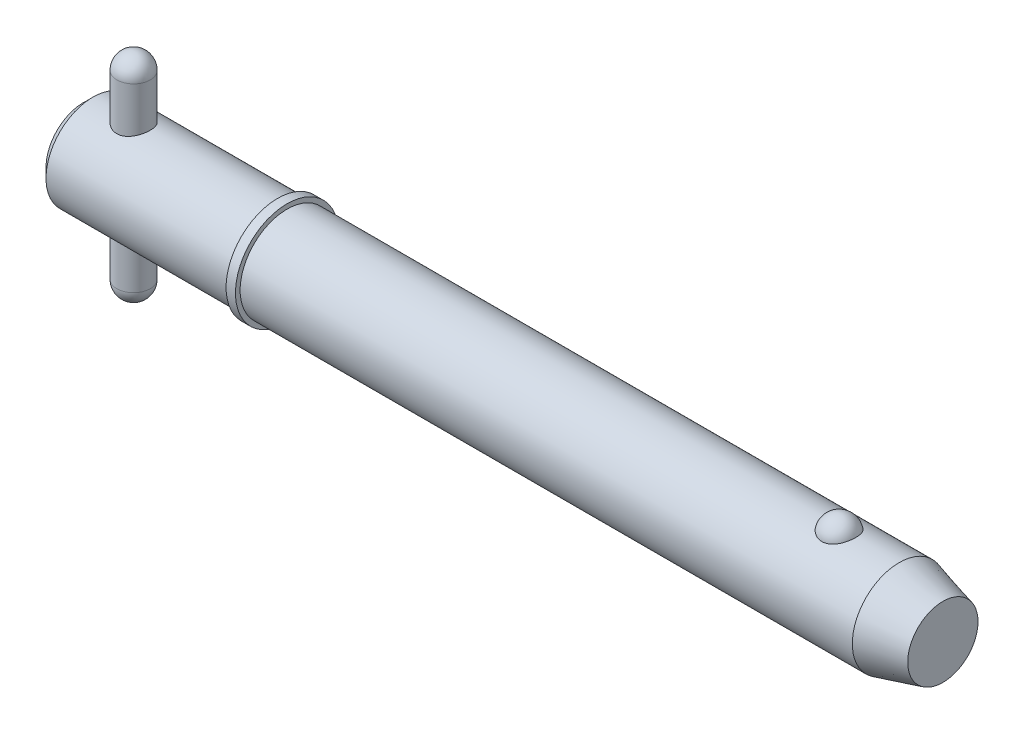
ISO-10303-21;
HEADER;
FILE_DESCRIPTION(('STEP AP214'),'2;1');
FILE_NAME('part.step','',(''),(''),'','','');
FILE_SCHEMA(('AUTOMOTIVE_DESIGN { 1 0 10303 214 1 1 1 1 }'));
ENDSEC;
DATA;
#1=APPLICATION_CONTEXT('core data for automotive mechanical design processes');
#2=APPLICATION_PROTOCOL_DEFINITION('international standard','automotive_design',2000,#1);
#3=PRODUCT_CONTEXT('',#1,'mechanical');
#4=PRODUCT('Part','Part','',(#3));
#5=PRODUCT_RELATED_PRODUCT_CATEGORY('part','',(#4));
#6=PRODUCT_DEFINITION_FORMATION('','',#4);
#7=PRODUCT_DEFINITION_CONTEXT('part definition',#1,'design');
#8=PRODUCT_DEFINITION('design','',#6,#7);
#9=PRODUCT_DEFINITION_SHAPE('','',#8);
#10=(LENGTH_UNIT() NAMED_UNIT(*) SI_UNIT(.MILLI.,.METRE.));
#11=(NAMED_UNIT(*) PLANE_ANGLE_UNIT() SI_UNIT($,.RADIAN.));
#12=(NAMED_UNIT(*) SI_UNIT($,.STERADIAN.) SOLID_ANGLE_UNIT());
#13=UNCERTAINTY_MEASURE_WITH_UNIT(LENGTH_MEASURE(1.E-05),#10,'distance_accuracy_value','');
#14=(GEOMETRIC_REPRESENTATION_CONTEXT(3) GLOBAL_UNCERTAINTY_ASSIGNED_CONTEXT((#13)) GLOBAL_UNIT_ASSIGNED_CONTEXT((#10,
#11,#12)) REPRESENTATION_CONTEXT('',''));
#15=CARTESIAN_POINT('',(0.,0.,0.));
#16=DIRECTION('',(0.,0.,1.));
#17=DIRECTION('',(1.,0.,0.));
#18=AXIS2_PLACEMENT_3D('',#15,#16,#17);
#19=CARTESIAN_POINT('',(5.94,12.7,0.));
#20=DIRECTION('',(0.,-1.,0.));
#21=DIRECTION('',(0.,0.,-1.));
#22=AXIS2_PLACEMENT_3D('',#19,#20,#21);
#23=CYLINDRICAL_SURFACE('',#22,1.98);
#24=CARTESIAN_POINT('',(5.94,-10.72,0.));
#25=DIRECTION('',(0.,-1.,0.));
#26=DIRECTION('',(0.,0.,-1.));
#27=AXIS2_PLACEMENT_3D('',#24,#25,#26);
#28=CIRCLE('',#27,1.98);
#29=CARTESIAN_POINT('',(5.94,-10.72,-1.98));
#30=VERTEX_POINT('',#29);
#31=EDGE_CURVE('P0_E10',#30,#30,#28,.F.);
#32=ORIENTED_EDGE('',*,*,#31,.T.);
#33=EDGE_LOOP('',(#32));
#34=FACE_BOUND('',#33,.T.);
#35=CARTESIAN_POINT('',(5.94,10.72,0.));
#36=DIRECTION('',(0.,-1.,0.));
#37=DIRECTION('',(0.,0.,-1.));
#38=AXIS2_PLACEMENT_3D('',#35,#36,#37);
#39=CIRCLE('',#38,1.98);
#40=CARTESIAN_POINT('',(5.94,10.72,-1.98));
#41=VERTEX_POINT('',#40);
#42=EDGE_CURVE('P0_E21',#41,#41,#39,.T.);
#43=ORIENTED_EDGE('',*,*,#42,.T.);
#44=EDGE_LOOP('',(#43));
#45=FACE_BOUND('',#44,.T.);
#46=ADVANCED_FACE('P0_F14',(#34,#45),#23,.T.);
#47=CARTESIAN_POINT('',(5.94,-10.72,0.));
#48=DIRECTION('',(0.,0.,1.));
#49=DIRECTION('',(1.,0.,0.));
#50=AXIS2_PLACEMENT_3D('',#47,#48,#49);
#51=SPHERICAL_SURFACE('',#50,1.98);
#52=CARTESIAN_POINT('',(5.94,-10.72,0.));
#53=DIRECTION('',(0.,-1.,0.));
#54=DIRECTION('',(0.,0.,-1.));
#55=AXIS2_PLACEMENT_3D('',#52,#53,#54);
#56=SPHERICAL_SURFACE('',#55,1.98);
#57=ORIENTED_EDGE('',*,*,#31,.F.);
#58=EDGE_LOOP('',(#57));
#59=FACE_BOUND('',#58,.T.);
#60=ADVANCED_FACE('P0_F29',(#59),#56,.T.);
#61=CARTESIAN_POINT('',(5.94,10.72,0.));
#62=DIRECTION('',(0.,0.,1.));
#63=DIRECTION('',(1.,0.,0.));
#64=AXIS2_PLACEMENT_3D('',#61,#62,#63);
#65=SPHERICAL_SURFACE('',#64,1.98);
#66=CARTESIAN_POINT('',(5.94,10.72,0.));
#67=DIRECTION('',(0.,-1.,0.));
#68=DIRECTION('',(0.,0.,-1.));
#69=AXIS2_PLACEMENT_3D('',#66,#67,#68);
#70=SPHERICAL_SURFACE('',#69,1.98);
#71=ORIENTED_EDGE('',*,*,#42,.F.);
#72=EDGE_LOOP('',(#71));
#73=FACE_BOUND('',#72,.T.);
#74=ADVANCED_FACE('P0_F16',(#73),#70,.T.);
#75=CLOSED_SHELL('',(#46,#60,#74));
#76=MANIFOLD_SOLID_BREP('P0_B1',#75);
#77=CARTESIAN_POINT('',(0.,0.,0.));
#78=DIRECTION('',(1.,0.,0.));
#79=DIRECTION('',(0.,0.,-1.));
#80=AXIS2_PLACEMENT_3D('',#77,#78,#79);
#81=CYLINDRICAL_SURFACE('',#80,5.555);
#82=CARTESIAN_POINT('',(96.7171144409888,0.,0.));
#83=DIRECTION('',(1.,0.,0.));
#84=DIRECTION('',(0.,0.,-1.));
#85=AXIS2_PLACEMENT_3D('',#82,#83,#84);
#86=CIRCLE('',#85,5.555);
#87=CARTESIAN_POINT('',(96.7171144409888,0.,-5.555));
#88=VERTEX_POINT('',#87);
#89=EDGE_CURVE('P1_E81',#88,#88,#86,.T.);
#90=ORIENTED_EDGE('',*,*,#89,.F.);
#91=EDGE_LOOP('',(#90));
#92=FACE_BOUND('',#91,.T.);
#93=CARTESIAN_POINT('',(24.13,0.,0.));
#94=DIRECTION('',(1.,0.,0.));
#95=DIRECTION('',(0.,0.,-1.));
#96=AXIS2_PLACEMENT_3D('',#93,#94,#95);
#97=CIRCLE('',#96,5.555);
#98=CARTESIAN_POINT('',(24.13,0.,-5.555));
#99=VERTEX_POINT('',#98);
#100=EDGE_CURVE('P1_E85',#99,#99,#97,.T.);
#101=ORIENTED_EDGE('',*,*,#100,.T.);
#102=EDGE_LOOP('',(#101));
#103=FACE_BOUND('',#102,.T.);
#104=CARTESIAN_POINT('',(89.5986264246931,5.16741224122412,2.03859650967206));
#105=CARTESIAN_POINT('',(89.4929492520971,5.16740893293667,2.03859990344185));
#106=CARTESIAN_POINT('',(89.3872989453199,5.17079470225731,2.03008306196));
#107=CARTESIAN_POINT('',(89.1791419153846,5.18392795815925,1.99630721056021));
#108=CARTESIAN_POINT('',(89.0766344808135,5.19367399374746,1.97105201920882));
#109=CARTESIAN_POINT('',(88.8777710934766,5.21839168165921,1.90463997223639));
#110=CARTESIAN_POINT('',(88.7814064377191,5.23335573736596,1.86350622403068));
#111=CARTESIAN_POINT('',(88.5970804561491,5.26688076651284,1.76652592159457));
#112=CARTESIAN_POINT('',(88.5091207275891,5.28544242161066,1.71067657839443));
#113=CARTESIAN_POINT('',(88.341265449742,5.32479845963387,1.58399959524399));
#114=CARTESIAN_POINT('',(88.2616656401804,5.34564089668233,1.51279545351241));
#115=CARTESIAN_POINT('',(88.1151290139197,5.38697258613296,1.3582858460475));
#116=CARTESIAN_POINT('',(88.048194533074,5.40746177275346,1.27497815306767));
#117=CARTESIAN_POINT('',(87.9256103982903,5.44694508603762,1.09440293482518));
#118=CARTESIAN_POINT('',(87.870598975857,5.46583143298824,0.996677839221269));
#119=CARTESIAN_POINT('',(87.7769376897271,5.49908030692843,0.792961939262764));
#120=CARTESIAN_POINT('',(87.7382894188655,5.513442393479,0.686970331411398));
#121=CARTESIAN_POINT('',(87.6776807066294,5.536358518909,0.468019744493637));
#122=CARTESIAN_POINT('',(87.6559725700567,5.54482455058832,0.354981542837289));
#123=CARTESIAN_POINT('',(87.6306362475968,5.55473324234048,0.126595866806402));
#124=CARTESIAN_POINT('',(87.6270077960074,5.55617600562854,0.0112484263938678));
#125=CARTESIAN_POINT('',(87.6378817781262,5.55189984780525,-0.218011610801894));
#126=CARTESIAN_POINT('',(87.6523151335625,5.54620821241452,-0.331928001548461));
#127=CARTESIAN_POINT('',(87.698903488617,5.52828920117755,-0.555544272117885));
#128=CARTESIAN_POINT('',(87.7310588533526,5.51606169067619,-0.665244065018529));
#129=CARTESIAN_POINT('',(87.8124883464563,5.48630779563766,-0.877469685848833));
#130=CARTESIAN_POINT('',(87.861781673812,5.4687754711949,-0.979987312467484));
#131=CARTESIAN_POINT('',(87.9764785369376,5.43024700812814,-1.17486975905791));
#132=CARTESIAN_POINT('',(88.0418831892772,5.40925062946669,-1.26723387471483));
#133=CARTESIAN_POINT('',(88.1875712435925,5.36600927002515,-1.43940133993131));
#134=CARTESIAN_POINT('',(88.2678859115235,5.34376173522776,-1.51917763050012));
#135=CARTESIAN_POINT('',(88.4414520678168,5.30057971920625,-1.66360338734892));
#136=CARTESIAN_POINT('',(88.534702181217,5.27964509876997,-1.72825445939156));
#137=CARTESIAN_POINT('',(88.7293939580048,5.24205250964,-1.83909478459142));
#138=CARTESIAN_POINT('',(88.8305900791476,5.22530519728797,-1.88568407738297));
#139=CARTESIAN_POINT('',(89.0401552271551,5.1975091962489,-1.96100802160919));
#140=CARTESIAN_POINT('',(89.1485215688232,5.1864583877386,-1.98974931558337));
#141=CARTESIAN_POINT('',(89.3634989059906,5.17184410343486,-2.02742262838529));
#142=CARTESIAN_POINT('',(89.469925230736,5.1679328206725,-2.03727608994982));
#143=CARTESIAN_POINT('',(89.6829925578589,5.16698995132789,-2.03966777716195));
#144=CARTESIAN_POINT('',(89.7896335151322,5.16995704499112,-2.03220932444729));
#145=CARTESIAN_POINT('',(89.9967730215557,5.18222383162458,-2.00071170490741));
#146=CARTESIAN_POINT('',(90.0973599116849,5.19133213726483,-1.97717337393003));
#147=CARTESIAN_POINT('',(90.2930141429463,5.21467637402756,-1.91475248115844));
#148=CARTESIAN_POINT('',(90.3880810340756,5.22891272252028,-1.87586867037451));
#149=CARTESIAN_POINT('',(90.5723711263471,5.26137066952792,-1.7828271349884));
#150=CARTESIAN_POINT('',(90.6614190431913,5.27967329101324,-1.72835124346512));
#151=CARTESIAN_POINT('',(90.8292880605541,5.3181741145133,-1.6059748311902));
#152=CARTESIAN_POINT('',(90.9081068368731,5.33837274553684,-1.53807126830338));
#153=CARTESIAN_POINT('',(91.0575156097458,5.37968287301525,-1.38688970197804));
#154=CARTESIAN_POINT('',(91.1275058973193,5.40079011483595,-1.30301744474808));
#155=CARTESIAN_POINT('',(91.2530125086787,5.44074401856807,-1.12458170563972));
#156=CARTESIAN_POINT('',(91.3085262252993,5.4595902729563,-1.03001630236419));
#157=CARTESIAN_POINT('',(91.4055507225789,5.49369849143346,-0.829439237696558));
#158=CARTESIAN_POINT('',(91.4465483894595,5.50882422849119,-0.723155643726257));
#159=CARTESIAN_POINT('',(91.5111250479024,5.53310911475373,-0.504772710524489));
#160=CARTESIAN_POINT('',(91.5347036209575,5.54226812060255,-0.392673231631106));
#161=CARTESIAN_POINT('',(91.564013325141,5.55370358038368,-0.165459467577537));
#162=CARTESIAN_POINT('',(91.5696884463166,5.55595843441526,-0.0503368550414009));
#163=CARTESIAN_POINT('',(91.562916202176,5.55329317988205,0.179288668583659));
#164=CARTESIAN_POINT('',(91.5504690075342,5.54837313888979,0.293791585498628));
#165=CARTESIAN_POINT('',(91.5077798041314,5.53189037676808,0.518526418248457));
#166=CARTESIAN_POINT('',(91.477598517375,5.5203503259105,0.628771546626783));
#167=CARTESIAN_POINT('',(91.4000962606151,5.49182453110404,0.842318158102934));
#168=CARTESIAN_POINT('',(91.3527743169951,5.47483847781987,0.945619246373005));
#169=CARTESIAN_POINT('',(91.2417204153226,5.43710633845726,1.14281571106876));
#170=CARTESIAN_POINT('',(91.1779215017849,5.41634501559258,1.23667048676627));
#171=CARTESIAN_POINT('',(91.0353577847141,5.37334572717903,1.41185243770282));
#172=CARTESIAN_POINT('',(90.9565932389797,5.35110778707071,1.4931798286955));
#173=CARTESIAN_POINT('',(90.7864234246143,5.30779474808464,1.64049162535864));
#174=CARTESIAN_POINT('',(90.6951002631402,5.28671324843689,1.70656877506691));
#175=CARTESIAN_POINT('',(90.5017390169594,5.24804852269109,1.82201372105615));
#176=CARTESIAN_POINT('',(90.3997005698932,5.23046541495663,1.87138095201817));
#177=CARTESIAN_POINT('',(90.1836187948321,5.20042692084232,1.95335298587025));
#178=CARTESIAN_POINT('',(90.069260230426,5.18820192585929,1.98521734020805));
#179=CARTESIAN_POINT('',(89.8361307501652,5.17169804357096,2.02783294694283));
#180=CARTESIAN_POINT('',(89.7173616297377,5.16741595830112,2.03859269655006));
#181=CARTESIAN_POINT('',(89.5986264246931,5.16741224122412,2.03859650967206));
#182=B_SPLINE_CURVE_WITH_KNOTS('',3,(#104,#105,#106,#107,#108,#109,#110,#111,#112,#113,#114,
#115,#116,#117,#118,#119,#120,#121,#122,#123,#124,#125,#126,#127,#128,#129,#130,#131,#132,#133,
#134,#135,#136,#137,#138,#139,#140,#141,#142,#143,#144,#145,#146,#147,#148,#149,#150,#151,#152,
#153,#154,#155,#156,#157,#158,#159,#160,#161,#162,#163,#164,#165,#166,#167,#168,#169,#170,#171,
#172,#173,#174,#175,#176,#177,#178,#179,#180,#181),.UNSPECIFIED.,.T.,.F.,(4,2,2,2,2,2,2,2,2,2,2,
2,2,2,2,2,2,2,2,2,2,2,2,2,2,2,2,2,2,2,2,2,2,2,2,2,2,2,4),(0.,0.316595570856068,
0.633118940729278,0.949183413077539,1.26530783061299,1.59030762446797,1.91536729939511,
2.25495824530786,2.5945822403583,2.93917283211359,3.28375835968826,3.62703002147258,
3.97030875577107,4.31397329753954,4.65766166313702,5.0020790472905,5.34645984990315,
5.68270547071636,6.01882587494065,6.33808403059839,6.65728093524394,6.96696376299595,
7.27667180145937,7.59321535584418,7.90983070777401,8.24210387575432,8.57443684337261,
8.91755896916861,9.26068933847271,9.60489211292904,9.94909164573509,10.2921194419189,
10.6351667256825,10.9796305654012,11.3240884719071,11.6663928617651,12.0087088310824,
12.3645679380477,12.7202837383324),.UNSPECIFIED.);
#183=CARTESIAN_POINT('',(89.5986264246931,5.16741224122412,2.03859650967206));
#184=VERTEX_POINT('',#183);
#185=EDGE_CURVE('P1_E35',#184,#184,#182,.T.);
#186=ORIENTED_EDGE('',*,*,#185,.T.);
#187=EDGE_LOOP('',(#186));
#188=FACE_BOUND('',#187,.T.);
#189=ADVANCED_FACE('P1_F13',(#92,#103,#188),#81,.T.);
#190=CARTESIAN_POINT('',(0.,0.,0.));
#191=DIRECTION('',(-1.,0.,0.));
#192=DIRECTION('',(0.,0.,1.));
#193=AXIS2_PLACEMENT_3D('',#190,#191,#192);
#194=PLANE('',#193);
#195=CARTESIAN_POINT('',(0.,0.,0.));
#196=DIRECTION('',(1.,0.,0.));
#197=DIRECTION('',(0.,0.,-1.));
#198=AXIS2_PLACEMENT_3D('',#195,#196,#197);
#199=CIRCLE('',#198,4.444);
#200=CARTESIAN_POINT('',(0.,0.,-4.444));
#201=VERTEX_POINT('',#200);
#202=EDGE_CURVE('P1_E9',#201,#201,#199,.T.);
#203=ORIENTED_EDGE('',*,*,#202,.F.);
#204=EDGE_LOOP('',(#203));
#205=FACE_BOUND('',#204,.T.);
#206=ADVANCED_FACE('P1_F15',(#205),#194,.T.);
#207=CARTESIAN_POINT('',(1.111,0.,0.));
#208=DIRECTION('',(1.,0.,0.));
#209=DIRECTION('',(0.,0.,-1.));
#210=AXIS2_PLACEMENT_3D('',#207,#208,#209);
#211=CONICAL_SURFACE('',#210,5.555,0.78539816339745);
#212=ORIENTED_EDGE('',*,*,#202,.T.);
#213=EDGE_LOOP('',(#212));
#214=FACE_BOUND('',#213,.T.);
#215=CARTESIAN_POINT('',(1.111,0.,0.));
#216=DIRECTION('',(1.,0.,0.));
#217=DIRECTION('',(0.,0.,-1.));
#218=AXIS2_PLACEMENT_3D('',#215,#216,#217);
#219=CIRCLE('',#218,5.555);
#220=CARTESIAN_POINT('',(1.111,0.,-5.555));
#221=VERTEX_POINT('',#220);
#222=EDGE_CURVE('P1_E26',#221,#221,#219,.T.);
#223=ORIENTED_EDGE('',*,*,#222,.F.);
#224=EDGE_LOOP('',(#223));
#225=FACE_BOUND('',#224,.T.);
#226=ADVANCED_FACE('P1_F77',(#214,#225),#211,.T.);
#227=CARTESIAN_POINT('',(0.,0.,0.));
#228=DIRECTION('',(1.,0.,0.));
#229=DIRECTION('',(0.,0.,-1.));
#230=AXIS2_PLACEMENT_3D('',#227,#228,#229);
#231=CYLINDRICAL_SURFACE('',#230,5.555);
#232=CARTESIAN_POINT('',(5.94,-5.19014691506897,1.98));
#233=CARTESIAN_POINT('',(5.83264687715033,-5.19014494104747,1.98000226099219));
#234=CARTESIAN_POINT('',(5.7253094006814,-5.19351395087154,1.97123988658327));
#235=CARTESIAN_POINT('',(5.51384517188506,-5.20654291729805,1.93656219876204));
#236=CARTESIAN_POINT('',(5.40971858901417,-5.21620320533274,1.91064598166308));
#237=CARTESIAN_POINT('',(5.20778082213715,-5.24058443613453,1.84271148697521));
#238=CARTESIAN_POINT('',(5.10995634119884,-5.25529427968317,1.80072850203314));
#239=CARTESIAN_POINT('',(4.92270352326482,-5.28810012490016,1.70197537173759));
#240=CARTESIAN_POINT('',(4.83327743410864,-5.3061970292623,1.64520128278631));
#241=CARTESIAN_POINT('',(4.66135184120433,-5.34464714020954,1.51575187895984));
#242=CARTESIAN_POINT('',(4.57928277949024,-5.36506222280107,1.44252311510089));
#243=CARTESIAN_POINT('',(4.42829115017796,-5.40532920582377,1.28342047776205));
#244=CARTESIAN_POINT('',(4.35937105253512,-5.42518099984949,1.19754423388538));
#245=CARTESIAN_POINT('',(4.23461605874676,-5.46281133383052,1.01237205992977));
#246=CARTESIAN_POINT('',(4.17924129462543,-5.48050875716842,0.912748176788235));
#247=CARTESIAN_POINT('',(4.0862117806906,-5.51109938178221,0.70485824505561));
#248=CARTESIAN_POINT('',(4.0485515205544,-5.52399407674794,0.596594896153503));
#249=CARTESIAN_POINT('',(3.99350662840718,-5.54308759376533,0.379019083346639));
#250=CARTESIAN_POINT('',(3.97538263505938,-5.54952987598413,0.269915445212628));
#251=CARTESIAN_POINT('',(3.95756405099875,-5.55586205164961,0.0500378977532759));
#252=CARTESIAN_POINT('',(3.95786404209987,-5.55575387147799,-0.060735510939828));
#253=CARTESIAN_POINT('',(3.97643665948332,-5.54915684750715,-0.275539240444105));
#254=CARTESIAN_POINT('',(3.99390415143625,-5.54295384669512,-0.379649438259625));
#255=CARTESIAN_POINT('',(4.0449721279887,-5.52523170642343,-0.583350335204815));
#256=CARTESIAN_POINT('',(4.07857373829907,-5.51371219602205,-0.682940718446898));
#257=CARTESIAN_POINT('',(4.16137312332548,-5.4863099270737,-0.876423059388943));
#258=CARTESIAN_POINT('',(4.2107826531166,-5.47036834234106,-0.970215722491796));
#259=CARTESIAN_POINT('',(4.32361427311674,-5.43575653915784,-1.1484017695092));
#260=CARTESIAN_POINT('',(4.38704062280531,-5.41708549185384,-1.23279228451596));
#261=CARTESIAN_POINT('',(4.53006791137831,-5.37778429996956,-1.39454579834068));
#262=CARTESIAN_POINT('',(4.61035105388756,-5.35710277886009,-1.4712940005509));
#263=CARTESIAN_POINT('',(4.78279835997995,-5.31692766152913,-1.6104545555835));
#264=CARTESIAN_POINT('',(4.874964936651,-5.29743430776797,-1.67286398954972));
#265=CARTESIAN_POINT('',(5.07076688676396,-5.26153775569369,-1.78259698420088));
#266=CARTESIAN_POINT('',(5.17458163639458,-5.24519780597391,-1.8296227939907));
#267=CARTESIAN_POINT('',(5.38938990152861,-5.21818744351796,-1.90530278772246));
#268=CARTESIAN_POINT('',(5.50037985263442,-5.20751423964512,-1.93396601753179));
#269=CARTESIAN_POINT('',(5.72036376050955,-5.19369176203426,-1.97077654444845));
#270=CARTESIAN_POINT('',(5.82917370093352,-5.19018851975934,-1.97989015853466));
#271=CARTESIAN_POINT('',(6.04680100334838,-5.19010609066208,-1.98010779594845));
#272=CARTESIAN_POINT('',(6.15561835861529,-5.19352540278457,-1.97121572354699));
#273=CARTESIAN_POINT('',(6.36548036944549,-5.20654623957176,-1.93654727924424));
#274=CARTESIAN_POINT('',(6.46666051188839,-5.21588705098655,-1.91148218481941));
#275=CARTESIAN_POINT('',(6.66334537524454,-5.23939939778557,-1.84605494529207));
#276=CARTESIAN_POINT('',(6.75884899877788,-5.25357186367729,-1.8056898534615));
#277=CARTESIAN_POINT('',(6.94517989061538,-5.28576258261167,-1.70921153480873));
#278=CARTESIAN_POINT('',(7.03572661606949,-5.30389804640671,-1.65259670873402));
#279=CARTESIAN_POINT('',(7.20638087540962,-5.34176077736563,-1.52577523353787));
#280=CARTESIAN_POINT('',(7.28648490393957,-5.36148857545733,-1.45556404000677));
#281=CARTESIAN_POINT('',(7.43864697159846,-5.40165494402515,-1.2988614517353));
#282=CARTESIAN_POINT('',(7.50999887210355,-5.42207106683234,-1.21167640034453));
#283=CARTESIAN_POINT('',(7.63712639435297,-5.46023601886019,-1.026066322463));
#284=CARTESIAN_POINT('',(7.69290228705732,-5.47798489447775,-0.927641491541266));
#285=CARTESIAN_POINT('',(7.78684673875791,-5.50876590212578,-0.722633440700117));
#286=CARTESIAN_POINT('',(7.82510508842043,-5.52182201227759,-0.616095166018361));
#287=CARTESIAN_POINT('',(7.88297051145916,-5.54184206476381,-0.397530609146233));
#288=CARTESIAN_POINT('',(7.90258540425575,-5.5488085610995,-0.285506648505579));
#289=CARTESIAN_POINT('',(7.9218262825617,-5.55564472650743,-0.065566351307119));
#290=CARTESIAN_POINT('',(7.92245987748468,-5.55587212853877,0.0422515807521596));
#291=CARTESIAN_POINT('',(7.90626329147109,-5.55011340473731,0.256387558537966));
#292=CARTESIAN_POINT('',(7.88943488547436,-5.54412791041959,0.362705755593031));
#293=CARTESIAN_POINT('',(7.83948457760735,-5.52676548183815,0.568649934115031));
#294=CARTESIAN_POINT('',(7.8067003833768,-5.51550046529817,0.668367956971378));
#295=CARTESIAN_POINT('',(7.72609369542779,-5.48874437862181,0.860911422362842));
#296=CARTESIAN_POINT('',(7.67826838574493,-5.47325251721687,0.953735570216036));
#297=CARTESIAN_POINT('',(7.56675024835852,-5.43884382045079,1.13391068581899));
#298=CARTESIAN_POINT('',(7.50249968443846,-5.41981485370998,1.22089468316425));
#299=CARTESIAN_POINT('',(7.36086495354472,-5.38069275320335,1.38316665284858));
#300=CARTESIAN_POINT('',(7.28347630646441,-5.36059925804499,1.45845061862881));
#301=CARTESIAN_POINT('',(7.11347587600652,-5.32048380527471,1.59876646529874));
#302=CARTESIAN_POINT('',(7.02032386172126,-5.30050854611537,1.66315951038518));
#303=CARTESIAN_POINT('',(6.82388804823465,-5.26398994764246,1.77536801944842));
#304=CARTESIAN_POINT('',(6.7206049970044,-5.24744635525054,1.82318470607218));
#305=CARTESIAN_POINT('',(6.50639706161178,-5.21987969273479,1.90068230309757));
#306=CARTESIAN_POINT('',(6.3954529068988,-5.20887116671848,1.93031547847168));
#307=CARTESIAN_POINT('',(6.16966522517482,-5.19400760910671,1.96996824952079));
#308=CARTESIAN_POINT('',(6.05482366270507,-5.19014902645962,1.97999758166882));
#309=CARTESIAN_POINT('',(5.94,-5.19014691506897,1.98));
#310=B_SPLINE_CURVE_WITH_KNOTS('',3,(#232,#233,#234,#235,#236,#237,#238,#239,#240,#241,#242,
#243,#244,#245,#246,#247,#248,#249,#250,#251,#252,#253,#254,#255,#256,#257,#258,#259,#260,#261,
#262,#263,#264,#265,#266,#267,#268,#269,#270,#271,#272,#273,#274,#275,#276,#277,#278,#279,#280,
#281,#282,#283,#284,#285,#286,#287,#288,#289,#290,#291,#292,#293,#294,#295,#296,#297,#298,#299,
#300,#301,#302,#303,#304,#305,#306,#307,#308,#309),.UNSPECIFIED.,.T.,.F.,(4,2,2,2,2,2,2,2,2,2,2,
2,2,2,2,2,2,2,2,2,2,2,2,2,2,2,2,2,2,2,2,2,2,2,2,2,2,2,4),(0.,0.321632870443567,
0.643282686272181,0.964229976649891,1.28526292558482,1.61937087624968,1.9535415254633,
2.29784481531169,2.64204093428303,2.97269632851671,3.30325448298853,3.61901541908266,
3.93479838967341,4.25500220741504,4.57530346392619,4.91268648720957,5.25013812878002,
5.59378026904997,5.93725299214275,6.26331481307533,6.58930593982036,6.90185604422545,
7.21446637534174,7.53801472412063,7.86167140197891,8.20353561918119,8.54539388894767,
8.88547970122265,9.22542281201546,9.54728637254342,9.86911722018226,10.1844146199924,
10.4997710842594,10.827730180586,11.1558013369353,11.499115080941,11.8424034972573,
12.1865892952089,12.5306041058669),.UNSPECIFIED.);
#311=CARTESIAN_POINT('',(5.94,-5.19014691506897,1.98));
#312=VERTEX_POINT('',#311);
#313=EDGE_CURVE('P1_E17',#312,#312,#310,.T.);
#314=ORIENTED_EDGE('',*,*,#313,.F.);
#315=EDGE_LOOP('',(#314));
#316=FACE_BOUND('',#315,.T.);
#317=CARTESIAN_POINT('',(5.94,5.19014691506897,1.98));
#318=CARTESIAN_POINT('',(6.04735312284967,5.19014494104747,1.98000226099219));
#319=CARTESIAN_POINT('',(6.1546905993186,5.19351395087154,1.97123988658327));
#320=CARTESIAN_POINT('',(6.36615482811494,5.20654291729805,1.93656219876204));
#321=CARTESIAN_POINT('',(6.47028141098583,5.21620320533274,1.91064598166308));
#322=CARTESIAN_POINT('',(6.67221917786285,5.24058443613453,1.84271148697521));
#323=CARTESIAN_POINT('',(6.77004365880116,5.25529427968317,1.80072850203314));
#324=CARTESIAN_POINT('',(6.95729647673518,5.28810012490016,1.70197537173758));
#325=CARTESIAN_POINT('',(7.04672256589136,5.3061970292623,1.64520128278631));
#326=CARTESIAN_POINT('',(7.21864815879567,5.34464714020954,1.51575187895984));
#327=CARTESIAN_POINT('',(7.30071722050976,5.36506222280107,1.44252311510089));
#328=CARTESIAN_POINT('',(7.45170884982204,5.40532920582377,1.28342047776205));
#329=CARTESIAN_POINT('',(7.52062894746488,5.42518099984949,1.19754423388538));
#330=CARTESIAN_POINT('',(7.64538394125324,5.46281133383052,1.01237205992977));
#331=CARTESIAN_POINT('',(7.70075870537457,5.48050875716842,0.912748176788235));
#332=CARTESIAN_POINT('',(7.7937882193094,5.51109938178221,0.704858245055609));
#333=CARTESIAN_POINT('',(7.8314484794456,5.52399407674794,0.596594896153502));
#334=CARTESIAN_POINT('',(7.88649337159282,5.54308759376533,0.379019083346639));
#335=CARTESIAN_POINT('',(7.90461736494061,5.54952987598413,0.269915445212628));
#336=CARTESIAN_POINT('',(7.92243594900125,5.55586205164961,0.0500378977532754));
#337=CARTESIAN_POINT('',(7.92213595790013,5.55575387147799,-0.0607355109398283));
#338=CARTESIAN_POINT('',(7.90356334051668,5.54915684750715,-0.275539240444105));
#339=CARTESIAN_POINT('',(7.88609584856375,5.54295384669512,-0.379649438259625));
#340=CARTESIAN_POINT('',(7.8350278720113,5.52523170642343,-0.583350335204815));
#341=CARTESIAN_POINT('',(7.80142626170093,5.51371219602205,-0.682940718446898));
#342=CARTESIAN_POINT('',(7.71862687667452,5.4863099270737,-0.876423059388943));
#343=CARTESIAN_POINT('',(7.6692173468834,5.47036834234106,-0.970215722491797));
#344=CARTESIAN_POINT('',(7.55638572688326,5.43575653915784,-1.1484017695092));
#345=CARTESIAN_POINT('',(7.49295937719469,5.41708549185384,-1.23279228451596));
#346=CARTESIAN_POINT('',(7.34993208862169,5.37778429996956,-1.39454579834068));
#347=CARTESIAN_POINT('',(7.26964894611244,5.35710277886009,-1.4712940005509));
#348=CARTESIAN_POINT('',(7.09720164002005,5.31692766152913,-1.6104545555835));
#349=CARTESIAN_POINT('',(7.00503506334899,5.29743430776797,-1.67286398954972));
#350=CARTESIAN_POINT('',(6.80923311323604,5.26153775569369,-1.78259698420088));
#351=CARTESIAN_POINT('',(6.70541836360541,5.24519780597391,-1.8296227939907));
#352=CARTESIAN_POINT('',(6.49061009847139,5.21818744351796,-1.90530278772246));
#353=CARTESIAN_POINT('',(6.37962014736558,5.20751423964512,-1.93396601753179));
#354=CARTESIAN_POINT('',(6.15963623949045,5.19369176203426,-1.97077654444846));
#355=CARTESIAN_POINT('',(6.05082629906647,5.19018851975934,-1.97989015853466));
#356=CARTESIAN_POINT('',(5.83319899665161,5.19010609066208,-1.98010779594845));
#357=CARTESIAN_POINT('',(5.7243816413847,5.19352540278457,-1.97121572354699));
#358=CARTESIAN_POINT('',(5.5145196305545,5.20654623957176,-1.93654727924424));
#359=CARTESIAN_POINT('',(5.4133394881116,5.21588705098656,-1.91148218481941));
#360=CARTESIAN_POINT('',(5.21665462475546,5.23939939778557,-1.84605494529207));
#361=CARTESIAN_POINT('',(5.12115100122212,5.25357186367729,-1.8056898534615));
#362=CARTESIAN_POINT('',(4.93482010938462,5.28576258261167,-1.70921153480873));
#363=CARTESIAN_POINT('',(4.84427338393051,5.30389804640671,-1.65259670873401));
#364=CARTESIAN_POINT('',(4.67361912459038,5.34176077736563,-1.52577523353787));
#365=CARTESIAN_POINT('',(4.59351509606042,5.36148857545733,-1.45556404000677));
#366=CARTESIAN_POINT('',(4.44135302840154,5.40165494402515,-1.2988614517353));
#367=CARTESIAN_POINT('',(4.37000112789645,5.42207106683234,-1.21167640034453));
#368=CARTESIAN_POINT('',(4.24287360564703,5.46023601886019,-1.026066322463));
#369=CARTESIAN_POINT('',(4.18709771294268,5.47798489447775,-0.927641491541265));
#370=CARTESIAN_POINT('',(4.09315326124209,5.50876590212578,-0.722633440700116));
#371=CARTESIAN_POINT('',(4.05489491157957,5.52182201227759,-0.61609516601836));
#372=CARTESIAN_POINT('',(3.99702948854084,5.54184206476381,-0.397530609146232));
#373=CARTESIAN_POINT('',(3.97741459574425,5.5488085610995,-0.285506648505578));
#374=CARTESIAN_POINT('',(3.9581737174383,5.55564472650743,-0.0655663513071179));
#375=CARTESIAN_POINT('',(3.95754012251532,5.55587212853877,0.0422515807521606));
#376=CARTESIAN_POINT('',(3.97373670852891,5.55011340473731,0.256387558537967));
#377=CARTESIAN_POINT('',(3.99056511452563,5.54412791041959,0.362705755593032));
#378=CARTESIAN_POINT('',(4.04051542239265,5.52676548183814,0.568649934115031));
#379=CARTESIAN_POINT('',(4.07329961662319,5.51550046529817,0.668367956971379));
#380=CARTESIAN_POINT('',(4.15390630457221,5.48874437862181,0.860911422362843));
#381=CARTESIAN_POINT('',(4.20173161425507,5.47325251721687,0.953735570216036));
#382=CARTESIAN_POINT('',(4.31324975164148,5.43884382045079,1.13391068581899));
#383=CARTESIAN_POINT('',(4.37750031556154,5.41981485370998,1.22089468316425));
#384=CARTESIAN_POINT('',(4.51913504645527,5.38069275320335,1.38316665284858));
#385=CARTESIAN_POINT('',(4.59652369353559,5.36059925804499,1.45845061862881));
#386=CARTESIAN_POINT('',(4.76652412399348,5.32048380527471,1.59876646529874));
#387=CARTESIAN_POINT('',(4.85967613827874,5.30050854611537,1.66315951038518));
#388=CARTESIAN_POINT('',(5.05611195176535,5.26398994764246,1.77536801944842));
#389=CARTESIAN_POINT('',(5.1593950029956,5.24744635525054,1.82318470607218));
#390=CARTESIAN_POINT('',(5.37360293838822,5.21987969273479,1.90068230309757));
#391=CARTESIAN_POINT('',(5.4845470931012,5.20887116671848,1.93031547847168));
#392=CARTESIAN_POINT('',(5.71033477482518,5.19400760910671,1.96996824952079));
#393=CARTESIAN_POINT('',(5.82517633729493,5.19014902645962,1.97999758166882));
#394=CARTESIAN_POINT('',(5.94,5.19014691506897,1.98));
#395=B_SPLINE_CURVE_WITH_KNOTS('',3,(#317,#318,#319,#320,#321,#322,#323,#324,#325,#326,#327,
#328,#329,#330,#331,#332,#333,#334,#335,#336,#337,#338,#339,#340,#341,#342,#343,#344,#345,#346,
#347,#348,#349,#350,#351,#352,#353,#354,#355,#356,#357,#358,#359,#360,#361,#362,#363,#364,#365,
#366,#367,#368,#369,#370,#371,#372,#373,#374,#375,#376,#377,#378,#379,#380,#381,#382,#383,#384,
#385,#386,#387,#388,#389,#390,#391,#392,#393,#394),.UNSPECIFIED.,.T.,.F.,(4,2,2,2,2,2,2,2,2,2,2,
2,2,2,2,2,2,2,2,2,2,2,2,2,2,2,2,2,2,2,2,2,2,2,2,2,2,2,4),(0.,0.321632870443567,
0.643282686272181,0.964229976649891,1.28526292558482,1.61937087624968,1.9535415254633,
2.29784481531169,2.64204093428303,2.97269632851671,3.30325448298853,3.61901541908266,
3.93479838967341,4.25500220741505,4.57530346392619,4.91268648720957,5.25013812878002,
5.59378026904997,5.93725299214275,6.26331481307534,6.58930593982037,6.90185604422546,
7.21446637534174,7.53801472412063,7.86167140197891,8.20353561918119,8.54539388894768,
8.88547970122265,9.22542281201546,9.54728637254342,9.86911722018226,10.1844146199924,
10.4997710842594,10.827730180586,11.1558013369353,11.499115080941,11.8424034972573,
12.1865892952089,12.5306041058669),.UNSPECIFIED.);
#396=CARTESIAN_POINT('',(5.94,5.19014691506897,1.98));
#397=VERTEX_POINT('',#396);
#398=EDGE_CURVE('P1_E43',#397,#397,#395,.T.);
#399=ORIENTED_EDGE('',*,*,#398,.F.);
#400=EDGE_LOOP('',(#399));
#401=FACE_BOUND('',#400,.T.);
#402=ORIENTED_EDGE('',*,*,#222,.T.);
#403=EDGE_LOOP('',(#402));
#404=FACE_BOUND('',#403,.T.);
#405=CARTESIAN_POINT('',(23.019,0.,0.));
#406=DIRECTION('',(1.,0.,0.));
#407=DIRECTION('',(0.,0.,-1.));
#408=AXIS2_PLACEMENT_3D('',#405,#406,#407);
#409=CIRCLE('',#408,5.555);
#410=CARTESIAN_POINT('',(23.019,0.,-5.555));
#411=VERTEX_POINT('',#410);
#412=EDGE_CURVE('P1_E31',#411,#411,#409,.T.);
#413=ORIENTED_EDGE('',*,*,#412,.F.);
#414=EDGE_LOOP('',(#413));
#415=FACE_BOUND('',#414,.T.);
#416=ADVANCED_FACE('P1_F103',(#316,#401,#404,#415),#231,.T.);
#417=CARTESIAN_POINT('',(23.019,5.555,0.));
#418=DIRECTION('',(-1.,0.,0.));
#419=DIRECTION('',(0.,0.,1.));
#420=AXIS2_PLACEMENT_3D('',#417,#418,#419);
#421=PLANE('',#420);
#422=ORIENTED_EDGE('',*,*,#412,.T.);
#423=EDGE_LOOP('',(#422));
#424=FACE_BOUND('',#423,.T.);
#425=CARTESIAN_POINT('',(23.019,0.,0.));
#426=DIRECTION('',(1.,0.,0.));
#427=DIRECTION('',(0.,0.,-1.));
#428=AXIS2_PLACEMENT_3D('',#425,#426,#427);
#429=CIRCLE('',#428,6.1105);
#430=CARTESIAN_POINT('',(23.019,0.,-6.1105));
#431=VERTEX_POINT('',#430);
#432=EDGE_CURVE('P1_E91',#431,#431,#429,.T.);
#433=ORIENTED_EDGE('',*,*,#432,.F.);
#434=EDGE_LOOP('',(#433));
#435=FACE_BOUND('',#434,.T.);
#436=ADVANCED_FACE('P1_F100',(#424,#435),#421,.T.);
#437=CARTESIAN_POINT('',(0.,0.,0.));
#438=DIRECTION('',(1.,0.,0.));
#439=DIRECTION('',(0.,0.,-1.));
#440=AXIS2_PLACEMENT_3D('',#437,#438,#439);
#441=CYLINDRICAL_SURFACE('',#440,6.1105);
#442=ORIENTED_EDGE('',*,*,#432,.T.);
#443=EDGE_LOOP('',(#442));
#444=FACE_BOUND('',#443,.T.);
#445=CARTESIAN_POINT('',(24.13,0.,0.));
#446=DIRECTION('',(1.,0.,0.));
#447=DIRECTION('',(0.,0.,-1.));
#448=AXIS2_PLACEMENT_3D('',#445,#446,#447);
#449=CIRCLE('',#448,6.1105);
#450=CARTESIAN_POINT('',(24.13,0.,-6.1105));
#451=VERTEX_POINT('',#450);
#452=EDGE_CURVE('P1_E88',#451,#451,#449,.T.);
#453=ORIENTED_EDGE('',*,*,#452,.F.);
#454=EDGE_LOOP('',(#453));
#455=FACE_BOUND('',#454,.T.);
#456=ADVANCED_FACE('P1_F68',(#444,#455),#441,.T.);
#457=CARTESIAN_POINT('',(24.13,6.1105,0.));
#458=DIRECTION('',(1.,0.,0.));
#459=DIRECTION('',(0.,0.,-1.));
#460=AXIS2_PLACEMENT_3D('',#457,#458,#459);
#461=PLANE('',#460);
#462=ORIENTED_EDGE('',*,*,#452,.T.);
#463=EDGE_LOOP('',(#462));
#464=FACE_BOUND('',#463,.T.);
#465=ORIENTED_EDGE('',*,*,#100,.F.);
#466=EDGE_LOOP('',(#465));
#467=FACE_BOUND('',#466,.T.);
#468=ADVANCED_FACE('P1_F62',(#464,#467),#461,.T.);
#469=CARTESIAN_POINT('',(101.9,0.,0.));
#470=DIRECTION('',(-1.,0.,0.));
#471=DIRECTION('',(0.,0.,1.));
#472=AXIS2_PLACEMENT_3D('',#469,#470,#471);
#473=CONICAL_SURFACE('',#472,4.16625000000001,0.26179938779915);
#474=ORIENTED_EDGE('',*,*,#89,.T.);
#475=EDGE_LOOP('',(#474));
#476=FACE_BOUND('',#475,.T.);
#477=CARTESIAN_POINT('',(101.9,0.,0.));
#478=DIRECTION('',(1.,0.,0.));
#479=DIRECTION('',(0.,0.,-1.));
#480=AXIS2_PLACEMENT_3D('',#477,#478,#479);
#481=CIRCLE('',#480,4.16625000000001);
#482=CARTESIAN_POINT('',(101.9,0.,-4.16625000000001));
#483=VERTEX_POINT('',#482);
#484=EDGE_CURVE('P1_E42',#483,#483,#481,.T.);
#485=ORIENTED_EDGE('',*,*,#484,.F.);
#486=EDGE_LOOP('',(#485));
#487=FACE_BOUND('',#486,.T.);
#488=ADVANCED_FACE('P1_F59',(#476,#487),#473,.T.);
#489=CARTESIAN_POINT('',(101.9,4.16625000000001,0.));
#490=DIRECTION('',(1.,0.,0.));
#491=DIRECTION('',(0.,0.,-1.));
#492=AXIS2_PLACEMENT_3D('',#489,#490,#491);
#493=PLANE('',#492);
#494=ORIENTED_EDGE('',*,*,#484,.T.);
#495=EDGE_LOOP('',(#494));
#496=FACE_BOUND('',#495,.T.);
#497=ADVANCED_FACE('P1_F55',(#496),#493,.T.);
#498=CARTESIAN_POINT('',(89.5986264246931,4.9995,0.));
#499=DIRECTION('',(-1.,0.,0.));
#500=DIRECTION('',(0.,1.,0.));
#501=AXIS2_PLACEMENT_3D('',#498,#499,#500);
#502=SPHERICAL_SURFACE('',#501,2.04550000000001);
#503=ORIENTED_EDGE('',*,*,#185,.F.);
#504=EDGE_LOOP('',(#503));
#505=FACE_BOUND('',#504,.T.);
#506=ADVANCED_FACE('P1_F50',(#505),#502,.T.);
#507=CARTESIAN_POINT('',(5.94,-6.1105,0.));
#508=DIRECTION('',(0.,1.,0.));
#509=DIRECTION('',(0.,0.,1.));
#510=AXIS2_PLACEMENT_3D('',#507,#508,#509);
#511=CYLINDRICAL_SURFACE('',#510,1.98);
#512=ORIENTED_EDGE('',*,*,#313,.T.);
#513=EDGE_LOOP('',(#512));
#514=FACE_BOUND('',#513,.T.);
#515=ORIENTED_EDGE('',*,*,#398,.T.);
#516=EDGE_LOOP('',(#515));
#517=FACE_BOUND('',#516,.T.);
#518=ADVANCED_FACE('P1_F54',(#514,#517),#511,.F.);
#519=CLOSED_SHELL('',(#189,#206,#226,#416,#436,#456,#468,#488,#497,#506,#518));
#520=MANIFOLD_SOLID_BREP('P1_B1',#519);
#521=ADVANCED_BREP_SHAPE_REPRESENTATION('',(#18,#76,#520),#14);
#522=SHAPE_DEFINITION_REPRESENTATION(#9,#521);
ENDSEC;
END-ISO-10303-21;
